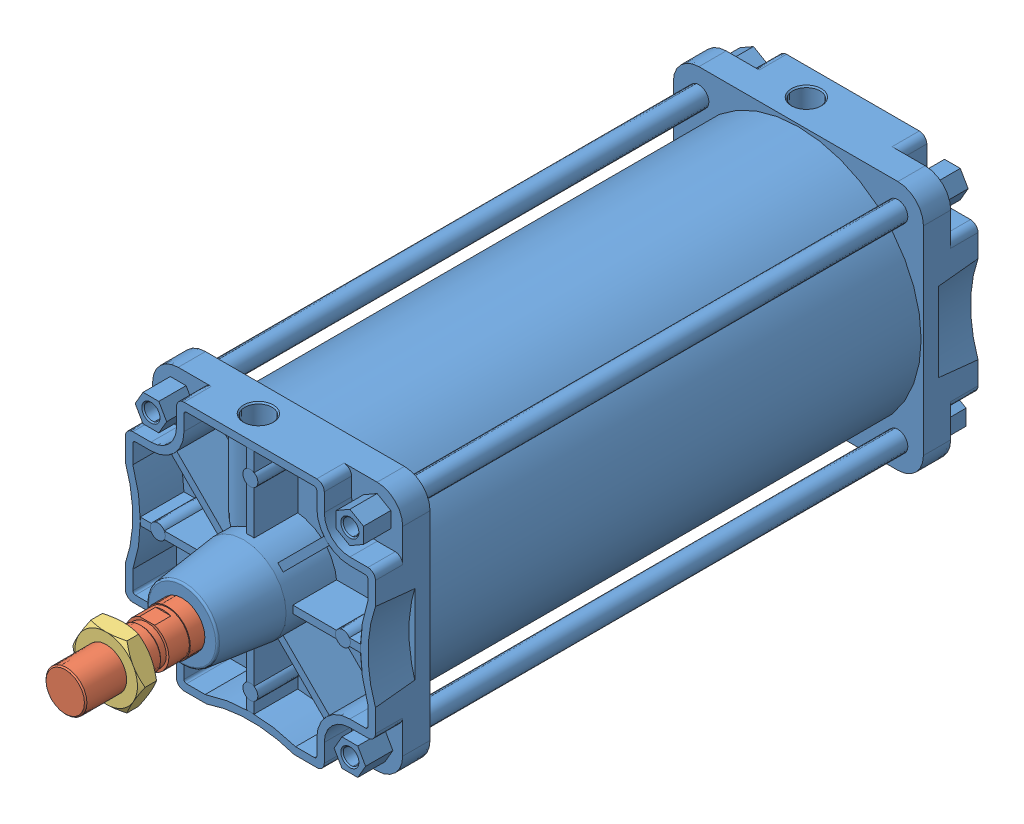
SolidWorks assembly 200_350_xl_n.SLDASM, configuration Default (file format 14000). Lengths in mm.
Overall size (220 220 698.86).
3 component instances, 3 part files, 3 mates.
Components (placement in the parent):
- 200_350_xl_n_01-1: 200_350_xl_n_01.SLDPRT [Default] at origin size (220 220 596)
- 200_350_xl_n_02-1: 200_350_xl_n_02.SLDPRT [Default] at (0 0 -4.1434) size (200 200 612)
- 200_350_xl_n_03-1: 200_350_xl_n_03.SLDPRT [Default] at (0 0 -4.1434) size (63.51 55 15)
Mates (geometry in assembly coordinates):
- Distanza1: distance = 36 mm aligned: plane of 200_350_xl_n_03-1 through (22.75 0 126.8566) normal (0 0 1); plane of 200_350_xl_n_02-1 through (0 -8.4587 162.8566) normal (0 0 1)
- Concentrico3: concentric aligned: cylinder of 200_350_xl_n_02-1 through (0 0 129.3766) axis (0 0 1) radius 18; cylinder of 200_350_xl_n_03-1 through (0 0 119.3566) axis (0 0 1) radius 16.9175
- Concentrico4: concentric aligned: cylinder of 200_350_xl_n_01-1 through (0 0 -189.5) axis (0 0 1) radius 20; cylinder of 200_350_xl_n_02-1 through (0 0 -188.1684) axis (0 0 1) radius 20
